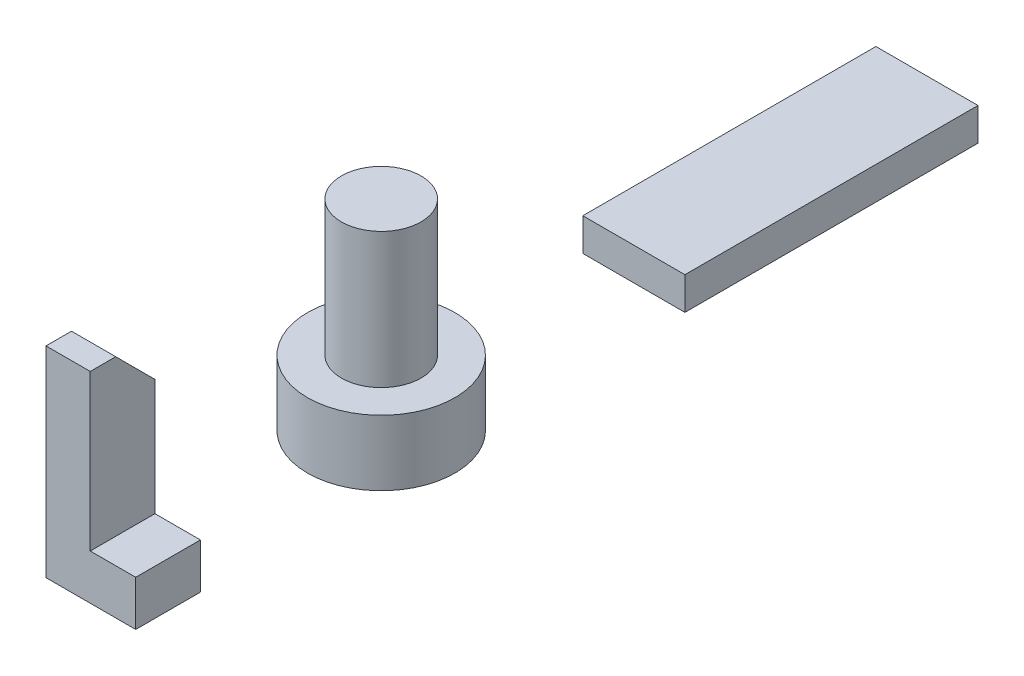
from build123d import *

# Parameters (mm, degrees)
EXTRUDE1_DEPTH = 25.146
CHAMFER1_SIZE  = 15.24
SKETCH2_R      = 28.650627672
EXTRUDE2_DEPTH = 25.4
SKETCH3_R      = 15.481230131
EXTRUDE3_DEPTH = 52.578
SKETCH4_W      = 39.681812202
SKETCH4_H      = 113.892109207
EXTRUDE4_DEPTH = 12.7


with BuildPart() as part:
    # Sketch1 → Extrude1 (new body)
    with BuildSketch(Plane.XY):
        Polygon((0, 0), (0, 17.575461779), (-17.668616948, 17.575461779), (-17.668616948, 78.014819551), (-34.857952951, 78.014819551), (-34.857952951, 0), align=None)
    extrude(amount=EXTRUDE1_DEPTH)

    # Chamfer1
    chamfer1_edges = [part.edges().sort_by_distance(p)[0] for p in [
        (-26.263284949, 78.014819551, 0),
    ]]
    chamfer(chamfer1_edges, length=CHAMFER1_SIZE)


with BuildPart() as body_2:
    # Sketch2 → Extrude2 (new body)
    with BuildSketch(Plane(origin=(0, 0, 0), x_dir=(1, 0, 0), z_dir=(0, 1, 0))):
        with Locations(Location((-19.238805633, 89.49952445, 0), (0, 0, 270))):
            Circle(SKETCH2_R)
    extrude(amount=EXTRUDE2_DEPTH)

    # Sketch3 → Extrude3 (add)
    with BuildSketch(Plane(origin=(0, 25.4, 0), x_dir=(1, 0, 0), z_dir=(0, 1, 0))):
        with Locations(Location((-19.238805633, 89.49952445, 0), (0, 0, 270))):
            Circle(SKETCH3_R)
    extrude(amount=EXTRUDE3_DEPTH)


with BuildPart() as body_3:
    # Sketch4 → Extrude4 (new body)
    with BuildSketch(Plane(origin=(0, 0, 0), x_dir=(1, 0, 0), z_dir=(0, 1, 0))):
        with Locations((-19.840906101, 245.22703272)):
            Rectangle(SKETCH4_W, SKETCH4_H)
    extrude(amount=EXTRUDE4_DEPTH)


solid = Compound([part.part, body_2.part, body_3.part])
